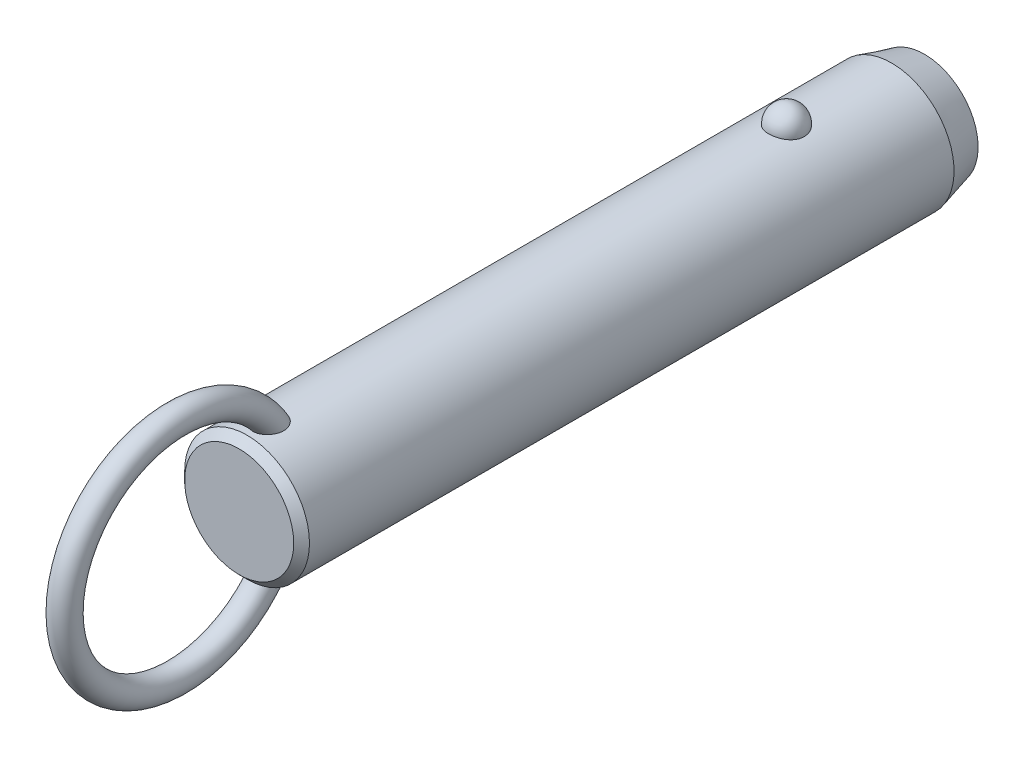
ISO-10303-21;
HEADER;
FILE_DESCRIPTION(('STEP AP214'),'2;1');
FILE_NAME('part.step','',(''),(''),'','','');
FILE_SCHEMA(('AUTOMOTIVE_DESIGN { 1 0 10303 214 1 1 1 1 }'));
ENDSEC;
DATA;
#1=APPLICATION_CONTEXT('core data for automotive mechanical design processes');
#2=APPLICATION_PROTOCOL_DEFINITION('international standard','automotive_design',2000,#1);
#3=PRODUCT_CONTEXT('',#1,'mechanical');
#4=PRODUCT('Part','Part','',(#3));
#5=PRODUCT_RELATED_PRODUCT_CATEGORY('part','',(#4));
#6=PRODUCT_DEFINITION_FORMATION('','',#4);
#7=PRODUCT_DEFINITION_CONTEXT('part definition',#1,'design');
#8=PRODUCT_DEFINITION('design','',#6,#7);
#9=PRODUCT_DEFINITION_SHAPE('','',#8);
#10=(LENGTH_UNIT() NAMED_UNIT(*) SI_UNIT(.MILLI.,.METRE.));
#11=(NAMED_UNIT(*) PLANE_ANGLE_UNIT() SI_UNIT($,.RADIAN.));
#12=(NAMED_UNIT(*) SI_UNIT($,.STERADIAN.) SOLID_ANGLE_UNIT());
#13=UNCERTAINTY_MEASURE_WITH_UNIT(LENGTH_MEASURE(1.E-05),#10,'distance_accuracy_value','');
#14=(GEOMETRIC_REPRESENTATION_CONTEXT(3) GLOBAL_UNCERTAINTY_ASSIGNED_CONTEXT((#13)) GLOBAL_UNIT_ASSIGNED_CONTEXT((#10,
#11,#12)) REPRESENTATION_CONTEXT('',''));
#15=CARTESIAN_POINT('',(0.,0.,0.));
#16=DIRECTION('',(0.,0.,1.));
#17=DIRECTION('',(1.,0.,0.));
#18=AXIS2_PLACEMENT_3D('',#15,#16,#17);
#19=CARTESIAN_POINT('',(0.,0.,71.1));
#20=DIRECTION('',(0.,0.,-1.));
#21=DIRECTION('',(-1.,0.,0.));
#22=AXIS2_PLACEMENT_3D('',#19,#20,#21);
#23=CYLINDRICAL_SURFACE('',#22,9.5);
#24=CARTESIAN_POINT('',(2.67259918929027,9.11631578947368,-2.70000000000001));
#25=CARTESIAN_POINT('',(2.6725968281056,9.11631786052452,-2.54909854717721));
#26=CARTESIAN_POINT('',(2.66030567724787,9.11994722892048,-2.39816735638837));
#27=CARTESIAN_POINT('',(2.6114347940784,9.13405924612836,-2.10058568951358));
#28=CARTESIAN_POINT('',(2.57484658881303,9.14454428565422,-1.95393672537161));
#29=CARTESIAN_POINT('',(2.47830875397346,9.17117631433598,-1.66916069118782));
#30=CARTESIAN_POINT('',(2.41836936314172,9.18732082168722,-1.53102991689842));
#31=CARTESIAN_POINT('',(2.27661331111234,9.22346780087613,-1.26705393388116));
#32=CARTESIAN_POINT('',(2.19479699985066,9.24347021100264,-1.14120852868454));
#33=CARTESIAN_POINT('',(2.01085282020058,9.28522401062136,-0.904632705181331));
#34=CARTESIAN_POINT('',(1.90862396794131,9.30698376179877,-0.793982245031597));
#35=CARTESIAN_POINT('',(1.6867437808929,9.34973971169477,-0.591607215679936));
#36=CARTESIAN_POINT('',(1.56709244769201,9.37073591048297,-0.499882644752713));
#37=CARTESIAN_POINT('',(1.31393976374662,9.40956370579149,-0.338167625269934));
#38=CARTESIAN_POINT('',(1.18048026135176,9.42740444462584,-0.268113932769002));
#39=CARTESIAN_POINT('',(0.903154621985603,9.45799906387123,-0.151390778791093));
#40=CARTESIAN_POINT('',(0.759289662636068,9.47075351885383,-0.104718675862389));
#41=CARTESIAN_POINT('',(0.468074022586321,9.48956256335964,-0.0367633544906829));
#42=CARTESIAN_POINT('',(0.320836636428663,9.49573643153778,-0.0150275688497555));
#43=CARTESIAN_POINT('',(0.0246714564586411,9.50112183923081,0.00396199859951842));
#44=CARTESIAN_POINT('',(-0.124256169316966,9.50033406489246,0.00121819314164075));
#45=CARTESIAN_POINT('',(-0.417264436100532,9.4919475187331,-0.0284441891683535));
#46=CARTESIAN_POINT('',(-0.56138413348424,9.48444885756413,-0.0550074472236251));
#47=CARTESIAN_POINT('',(-0.842986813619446,9.46357853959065,-0.131064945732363));
#48=CARTESIAN_POINT('',(-0.980469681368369,9.450206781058,-0.180559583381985));
#49=CARTESIAN_POINT('',(-1.24585005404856,9.41890822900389,-0.301476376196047));
#50=CARTESIAN_POINT('',(-1.37368611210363,9.40095498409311,-0.373026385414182));
#51=CARTESIAN_POINT('',(-1.61552738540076,9.36242964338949,-0.536025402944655));
#52=CARTESIAN_POINT('',(-1.72953116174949,9.34185727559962,-0.627476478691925));
#53=CARTESIAN_POINT('',(-1.9429225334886,9.29984568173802,-0.829844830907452));
#54=CARTESIAN_POINT('',(-2.04198021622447,9.27839736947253,-0.94110821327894));
#55=CARTESIAN_POINT('',(-2.22026460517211,9.23735994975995,-1.17883414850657));
#56=CARTESIAN_POINT('',(-2.29948985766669,9.21777097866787,-1.30529781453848));
#57=CARTESIAN_POINT('',(-2.43697287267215,9.18238994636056,-1.57158566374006));
#58=CARTESIAN_POINT('',(-2.49497068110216,9.16664569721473,-1.71155057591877));
#59=CARTESIAN_POINT('',(-2.5872073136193,9.14104303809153,-1.99961197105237));
#60=CARTESIAN_POINT('',(-2.62144683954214,9.13118445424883,-2.14770821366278));
#61=CARTESIAN_POINT('',(-2.66521466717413,9.11850622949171,-2.44715424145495));
#62=CARTESIAN_POINT('',(-2.67484831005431,9.11565658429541,-2.59848735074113));
#63=CARTESIAN_POINT('',(-2.66946735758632,9.11723375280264,-2.90067317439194));
#64=CARTESIAN_POINT('',(-2.65445345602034,9.12166036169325,-3.05152590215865));
#65=CARTESIAN_POINT('',(-2.60029711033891,9.13724422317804,-3.34766110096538));
#66=CARTESIAN_POINT('',(-2.56127978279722,9.14836656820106,-3.49296833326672));
#67=CARTESIAN_POINT('',(-2.46018844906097,9.17606676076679,-3.77477535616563));
#68=CARTESIAN_POINT('',(-2.39811349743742,9.1926448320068,-3.9112747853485));
#69=CARTESIAN_POINT('',(-2.25202303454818,9.22952198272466,-4.17244273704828));
#70=CARTESIAN_POINT('',(-2.16788714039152,9.24984129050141,-4.29704106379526));
#71=CARTESIAN_POINT('',(-1.9799408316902,9.29188255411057,-4.53013066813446));
#72=CARTESIAN_POINT('',(-1.87612963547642,9.31360456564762,-4.63862130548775));
#73=CARTESIAN_POINT('',(-1.65105429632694,9.35612959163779,-4.8369029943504));
#74=CARTESIAN_POINT('',(-1.52972405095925,9.37692871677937,-4.92661991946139));
#75=CARTESIAN_POINT('',(-1.27318250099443,9.41518970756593,-5.08429106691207));
#76=CARTESIAN_POINT('',(-1.13797219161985,9.432651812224,-5.15224684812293));
#77=CARTESIAN_POINT('',(-0.859280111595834,9.46208255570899,-5.26371827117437));
#78=CARTESIAN_POINT('',(-0.715925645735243,9.47411833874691,-5.30753421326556));
#79=CARTESIAN_POINT('',(-0.423550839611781,9.4916822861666,-5.37076321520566));
#80=CARTESIAN_POINT('',(-0.2745312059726,9.49721125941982,-5.39017930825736));
#81=CARTESIAN_POINT('',(0.0218446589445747,9.50110860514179,-5.40390587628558));
#82=CARTESIAN_POINT('',(0.16917707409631,9.49961381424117,-5.39869609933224));
#83=CARTESIAN_POINT('',(0.460808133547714,9.48993906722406,-5.36441955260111));
#84=CARTESIAN_POINT('',(0.605106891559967,9.48175936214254,-5.33535367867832));
#85=CARTESIAN_POINT('',(0.886027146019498,9.4596376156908,-5.25435587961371));
#86=CARTESIAN_POINT('',(1.02267710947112,9.44571881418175,-5.20251612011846));
#87=CARTESIAN_POINT('',(1.28523827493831,9.41358993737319,-5.07741549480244));
#88=CARTESIAN_POINT('',(1.41114877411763,9.39537958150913,-5.00415322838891));
#89=CARTESIAN_POINT('',(1.65085227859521,9.3562644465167,-4.83684599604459));
#90=CARTESIAN_POINT('',(1.76442346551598,9.33532178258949,-4.74249218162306));
#91=CARTESIAN_POINT('',(1.97425672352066,9.29321198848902,-4.53620389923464));
#92=CARTESIAN_POINT('',(2.07051582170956,9.27204482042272,-4.42426641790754));
#93=CARTESIAN_POINT('',(2.24490086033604,9.23139221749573,-4.18363183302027));
#94=CARTESIAN_POINT('',(2.32267019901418,9.21194380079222,-4.05466990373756));
#95=CARTESIAN_POINT('',(2.45584092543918,9.1773419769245,-3.78517836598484));
#96=CARTESIAN_POINT('',(2.5112497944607,9.16218713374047,-3.64465264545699));
#97=CARTESIAN_POINT('',(2.59380876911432,9.13913522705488,-3.37104301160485));
#98=CARTESIAN_POINT('',(2.62330266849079,9.13064624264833,-3.23871053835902));
#99=CARTESIAN_POINT('',(2.66269870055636,9.11923566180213,-2.97092664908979));
#100=CARTESIAN_POINT('',(2.67260130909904,9.11631393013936,-2.83547530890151));
#101=CARTESIAN_POINT('',(2.67259918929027,9.11631578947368,-2.70000000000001));
#102=B_SPLINE_CURVE_WITH_KNOTS('',3,(#24,#25,#26,#27,#28,#29,#30,#31,#32,#33,#34,#35,#36,#37,
#38,#39,#40,#41,#42,#43,#44,#45,#46,#47,#48,#49,#50,#51,#52,#53,#54,#55,#56,#57,#58,#59,#60,#61,
#62,#63,#64,#65,#66,#67,#68,#69,#70,#71,#72,#73,#74,#75,#76,#77,#78,#79,#80,#81,#82,#83,#84,#85,
#86,#87,#88,#89,#90,#91,#92,#93,#94,#95,#96,#97,#98,#99,#100,#101),.UNSPECIFIED.,.T.,.F.,(4,2,2,
2,2,2,2,2,2,2,2,2,2,2,2,2,2,2,2,2,2,2,2,2,2,2,2,2,2,2,2,2,2,2,2,2,2,2,4),(0.,0.452217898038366,
0.904593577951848,1.35677112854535,1.80894144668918,2.26340676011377,2.71787203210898,
3.17099820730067,3.62407318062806,4.0687883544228,4.51345969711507,4.95160616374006,
5.38976021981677,5.83050358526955,6.27129275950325,6.72071308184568,7.17016633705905,
7.62495278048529,8.07972578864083,8.53254856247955,8.98535859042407,9.43582813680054,
9.88631615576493,10.3393155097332,10.7923328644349,11.2471065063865,11.7018475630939,
12.150795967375,12.599688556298,13.0398725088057,13.4800399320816,13.9184421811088,
14.3568730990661,14.802202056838,15.2476074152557,15.7010097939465,16.1542603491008,
16.5602594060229,16.966248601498),.UNSPECIFIED.);
#103=CARTESIAN_POINT('',(2.67259918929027,9.11631578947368,-2.70000000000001));
#104=VERTEX_POINT('',#103);
#105=EDGE_CURVE('E41',#104,#104,#102,.T.);
#106=ORIENTED_EDGE('',*,*,#105,.T.);
#107=EDGE_LOOP('',(#106));
#108=FACE_BOUND('',#107,.T.);
#109=CARTESIAN_POINT('',(0.,0.,79.42));
#110=DIRECTION('',(0.,0.,1.));
#111=DIRECTION('',(1.,0.,0.));
#112=AXIS2_PLACEMENT_3D('',#109,#110,#111);
#113=CIRCLE('',#112,9.5);
#114=CARTESIAN_POINT('',(9.5,0.,79.42));
#115=VERTEX_POINT('',#114);
#116=EDGE_CURVE('E10',#115,#115,#113,.F.);
#117=ORIENTED_EDGE('',*,*,#116,.T.);
#118=EDGE_LOOP('',(#117));
#119=FACE_BOUND('',#118,.T.);
#120=CARTESIAN_POINT('',(-0.697062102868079,-9.47439269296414,73.7678088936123));
#121=CARTESIAN_POINT('',(-0.799579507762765,-9.46685146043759,73.8074823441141));
#122=CARTESIAN_POINT('',(-0.898575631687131,-9.45788043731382,73.8559309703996));
#123=CARTESIAN_POINT('',(-1.08670047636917,-9.43811593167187,73.9688685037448));
#124=CARTESIAN_POINT('',(-1.17583204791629,-9.42732297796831,74.0333527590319));
#125=CARTESIAN_POINT('',(-1.34179806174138,-9.40513672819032,74.1762099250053));
#126=CARTESIAN_POINT('',(-1.41865133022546,-9.39374438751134,74.254561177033));
#127=CARTESIAN_POINT('',(-1.5586004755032,-9.37154196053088,74.4227524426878));
#128=CARTESIAN_POINT('',(-1.62169476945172,-9.3607319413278,74.5125937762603));
#129=CARTESIAN_POINT('',(-1.73527695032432,-9.34035749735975,74.7045001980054));
#130=CARTESIAN_POINT('',(-1.7852226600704,-9.33085270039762,74.8068910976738));
#131=CARTESIAN_POINT('',(-1.86924997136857,-9.3143834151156,75.018148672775));
#132=CARTESIAN_POINT('',(-1.90332570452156,-9.30741986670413,75.1270177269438));
#133=CARTESIAN_POINT('',(-1.95893603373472,-9.29588482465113,75.3604730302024));
#134=CARTESIAN_POINT('',(-1.97872420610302,-9.29165182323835,75.4854890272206));
#135=CARTESIAN_POINT('',(-2.00062129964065,-9.28695978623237,75.7370805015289));
#136=CARTESIAN_POINT('',(-2.00272284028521,-9.28650232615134,75.863656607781));
#137=CARTESIAN_POINT('',(-1.98958876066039,-9.28932750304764,76.1368157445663));
#138=CARTESIAN_POINT('',(-1.97143366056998,-9.2932400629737,76.2832519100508));
#139=CARTESIAN_POINT('',(-1.91479925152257,-9.30507151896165,76.5720629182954));
#140=CARTESIAN_POINT('',(-1.87629122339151,-9.31299607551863,76.714431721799));
#141=CARTESIAN_POINT('',(-1.77225683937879,-9.33340232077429,77.0151725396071));
#142=CARTESIAN_POINT('',(-1.70334898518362,-9.34641636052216,77.1723691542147));
#143=CARTESIAN_POINT('',(-1.58111062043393,-9.36759153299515,77.3975171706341));
#144=CARTESIAN_POINT('',(-1.53721459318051,-9.37492619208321,77.4707968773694));
#145=CARTESIAN_POINT('',(-1.44302631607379,-9.38988566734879,77.6130740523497));
#146=CARTESIAN_POINT('',(-1.39273721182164,-9.39751033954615,77.6820736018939));
#147=CARTESIAN_POINT('',(-1.26775962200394,-9.41530678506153,77.8369832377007));
#148=CARTESIAN_POINT('',(-1.19052326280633,-9.42548108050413,77.9208712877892));
#149=CARTESIAN_POINT('',(-1.02420241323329,-9.44499825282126,78.0760086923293));
#150=CARTESIAN_POINT('',(-0.935139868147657,-9.45434261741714,78.1472808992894));
#151=CARTESIAN_POINT('',(-0.766610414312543,-9.46930670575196,78.2586955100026));
#152=CARTESIAN_POINT('',(-0.689439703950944,-9.47529223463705,78.3022354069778));
#153=CARTESIAN_POINT('',(-0.528942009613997,-9.48560294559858,78.3763133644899));
#154=CARTESIAN_POINT('',(-0.445620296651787,-9.48992953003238,78.4068624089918));
#155=CARTESIAN_POINT('',(-0.273901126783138,-9.49644161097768,78.4525792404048));
#156=CARTESIAN_POINT('',(-0.185465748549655,-9.49860811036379,78.46761059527));
#157=CARTESIAN_POINT('',(-0.00734541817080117,-9.5004135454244,78.4801494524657));
#158=CARTESIAN_POINT('',(0.0823387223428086,-9.50005405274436,78.4776678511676));
#159=CARTESIAN_POINT('',(0.247679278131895,-9.49708301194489,78.4569959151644));
#160=CARTESIAN_POINT('',(0.323620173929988,-9.49477609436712,78.4409300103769));
#161=CARTESIAN_POINT('',(0.471981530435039,-9.48855917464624,78.3971726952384));
#162=CARTESIAN_POINT('',(0.544400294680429,-9.48464840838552,78.3694757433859));
#163=CARTESIAN_POINT('',(0.70894789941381,-9.47398336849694,78.2928026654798));
#164=CARTESIAN_POINT('',(0.799149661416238,-9.46671310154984,78.2397745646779));
#165=CARTESIAN_POINT('',(0.969783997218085,-9.45076225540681,78.1199731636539));
#166=CARTESIAN_POINT('',(1.05019415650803,-9.44207854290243,78.0531692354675));
#167=CARTESIAN_POINT('',(1.23092343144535,-9.42051459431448,77.8807596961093));
#168=CARTESIAN_POINT('',(1.3265249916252,-9.40733378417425,77.7702619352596));
#169=CARTESIAN_POINT('',(1.49893121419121,-9.38140745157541,77.5355614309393));
#170=CARTESIAN_POINT('',(1.57571616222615,-9.36866239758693,77.4113445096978));
#171=CARTESIAN_POINT('',(1.71285426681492,-9.34457644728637,77.1493891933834));
#172=CARTESIAN_POINT('',(1.77266365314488,-9.33328726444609,77.0113623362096));
#173=CARTESIAN_POINT('',(1.87239208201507,-9.31379209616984,76.7280515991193));
#174=CARTESIAN_POINT('',(1.9123015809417,-9.3055875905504,76.582764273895));
#175=CARTESIAN_POINT('',(1.97604189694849,-9.29228394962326,76.2620281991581));
#176=CARTESIAN_POINT('',(1.99587438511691,-9.28797202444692,76.0857248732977));
#177=CARTESIAN_POINT('',(2.0029570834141,-9.28645519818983,75.7324146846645));
#178=CARTESIAN_POINT('',(1.99025930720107,-9.28923895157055,75.5554093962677));
#179=CARTESIAN_POINT('',(1.93735479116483,-9.30038134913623,75.2563381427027));
#180=CARTESIAN_POINT('',(1.90576827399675,-9.30697680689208,75.1326679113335));
#181=CARTESIAN_POINT('',(1.82287484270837,-9.32356855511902,74.892329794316));
#182=CARTESIAN_POINT('',(1.77158213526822,-9.33356239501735,74.7756569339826));
#183=CARTESIAN_POINT('',(1.64885744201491,-9.35602275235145,74.5527061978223));
#184=CARTESIAN_POINT('',(1.57730995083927,-9.36850332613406,74.4464927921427));
#185=CARTESIAN_POINT('',(1.4154326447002,-9.39431873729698,74.2495530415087));
#186=CARTESIAN_POINT('',(1.32510883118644,-9.40765330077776,74.1588217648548));
#187=CARTESIAN_POINT('',(1.13846223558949,-9.43195720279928,74.0050334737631));
#188=CARTESIAN_POINT('',(1.04369890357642,-9.44302894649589,73.9400947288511));
#189=CARTESIAN_POINT('',(0.843965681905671,-9.46296805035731,73.8280388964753));
#190=CARTESIAN_POINT('',(0.739000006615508,-9.47183631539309,73.7809144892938));
#191=CARTESIAN_POINT('',(0.528175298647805,-9.48586140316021,73.7081173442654));
#192=CARTESIAN_POINT('',(0.422686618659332,-9.49119633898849,73.6814024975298));
#193=CARTESIAN_POINT('',(0.208590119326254,-9.49831365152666,73.6460137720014));
#194=CARTESIAN_POINT('',(0.0999817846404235,-9.500095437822,73.6373428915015));
#195=CARTESIAN_POINT('',(-0.126104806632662,-9.49988861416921,73.6383501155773));
#196=CARTESIAN_POINT('',(-0.24357872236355,-9.49757821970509,73.6495942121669));
#197=CARTESIAN_POINT('',(-0.474390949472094,-9.48885165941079,73.693167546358));
#198=CARTESIAN_POINT('',(-0.587729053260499,-9.48243528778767,73.7254978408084));
#199=CARTESIAN_POINT('',(-0.697062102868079,-9.47439269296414,73.7678088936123));
#200=B_SPLINE_CURVE_WITH_KNOTS('',3,(#120,#121,#122,#123,#124,#125,#126,#127,#128,#129,#130,
#131,#132,#133,#134,#135,#136,#137,#138,#139,#140,#141,#142,#143,#144,#145,#146,#147,#148,#149,
#150,#151,#152,#153,#154,#155,#156,#157,#158,#159,#160,#161,#162,#163,#164,#165,#166,#167,#168,
#169,#170,#171,#172,#173,#174,#175,#176,#177,#178,#179,#180,#181,#182,#183,#184,#185,#186,#187,
#188,#189,#190,#191,#192,#193,#194,#195,#196,#197,#198,#199),.UNSPECIFIED.,.T.,.F.,(4,2,2,2,2,2,
2,2,2,2,2,2,2,2,2,2,2,2,2,2,2,2,2,2,2,2,2,2,2,2,2,2,2,2,2,2,2,2,2,4),(0.,0.330119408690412,
0.660143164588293,0.989655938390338,1.31920659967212,1.66074728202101,2.00241415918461,
2.38088696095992,2.7595176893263,3.20065679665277,3.6424200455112,4.15620996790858,
4.4131416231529,4.66994734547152,5.01228664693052,5.35399933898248,5.61943037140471,
5.88463652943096,6.15215502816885,6.41950709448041,6.65144391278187,6.88349136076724,
7.19641200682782,7.51003602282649,7.94779711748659,8.38601491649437,8.83699707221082,
9.28819530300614,9.81778662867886,10.3465317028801,10.7284172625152,11.110028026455,
11.4938603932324,11.8775702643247,12.2220189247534,12.5663259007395,12.8915939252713,
13.2169159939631,13.5689650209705,13.9210316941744),.UNSPECIFIED.);
#201=CARTESIAN_POINT('',(-0.697062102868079,-9.47439269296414,73.7678088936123));
#202=VERTEX_POINT('',#201);
#203=EDGE_CURVE('E59',#202,#202,#200,.T.);
#204=ORIENTED_EDGE('',*,*,#203,.T.);
#205=EDGE_LOOP('',(#204));
#206=FACE_BOUND('',#205,.T.);
#207=CARTESIAN_POINT('',(-0.697062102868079,9.47439269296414,73.7678088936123));
#208=CARTESIAN_POINT('',(-0.597792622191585,9.48169483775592,73.7293956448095));
#209=CARTESIAN_POINT('',(-0.495106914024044,9.48766580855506,73.6991682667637));
#210=CARTESIAN_POINT('',(-0.285876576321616,9.49627648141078,73.6560327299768));
#211=CARTESIAN_POINT('',(-0.179324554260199,9.49890941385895,73.6431597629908));
#212=CARTESIAN_POINT('',(0.034415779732,9.50053798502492,73.6351666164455));
#213=CARTESIAN_POINT('',(0.141603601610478,9.49953613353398,73.6400341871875));
#214=CARTESIAN_POINT('',(0.353563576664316,9.49401038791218,73.6673654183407));
#215=CARTESIAN_POINT('',(0.458336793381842,9.48948807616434,73.68982117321));
#216=CARTESIAN_POINT('',(0.66249373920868,9.4774236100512,73.7516719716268));
#217=CARTESIAN_POINT('',(0.761881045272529,9.46988348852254,73.7910556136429));
#218=CARTESIAN_POINT('',(0.952608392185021,9.45260382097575,73.8856342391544));
#219=CARTESIAN_POINT('',(1.04394806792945,9.44286417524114,73.9408299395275));
#220=CARTESIAN_POINT('',(1.21712767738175,9.42211760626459,74.0660662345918));
#221=CARTESIAN_POINT('',(1.29885671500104,9.41109835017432,74.1362579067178));
#222=CARTESIAN_POINT('',(1.44978975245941,9.38903310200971,74.288980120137));
#223=CARTESIAN_POINT('',(1.51899278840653,9.37798710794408,74.3715116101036));
#224=CARTESIAN_POINT('',(1.64602857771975,9.35654375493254,74.5497763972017));
#225=CARTESIAN_POINT('',(1.70333052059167,9.34618688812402,74.6458916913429));
#226=CARTESIAN_POINT('',(1.80259341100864,9.32755128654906,74.845897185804));
#227=CARTESIAN_POINT('',(1.84454942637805,9.31927322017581,74.9497898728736));
#228=CARTESIAN_POINT('',(1.91637039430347,9.30478365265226,75.1722131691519));
#229=CARTESIAN_POINT('',(1.944805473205,9.29882552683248,75.2912192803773));
#230=CARTESIAN_POINT('',(1.98449865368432,9.29043398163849,75.5321436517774));
#231=CARTESIAN_POINT('',(1.99574908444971,9.28800213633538,75.6540631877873));
#232=CARTESIAN_POINT('',(2.00275141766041,9.28649645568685,75.9169324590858));
#233=CARTESIAN_POINT('',(1.99588238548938,9.28799035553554,76.0579529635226));
#234=CARTESIAN_POINT('',(1.96270559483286,9.29505517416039,76.3376217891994));
#235=CARTESIAN_POINT('',(1.93637872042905,9.30063010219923,76.476267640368));
#236=CARTESIAN_POINT('',(1.85949176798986,9.31633564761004,76.7725616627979));
#237=CARTESIAN_POINT('',(1.80549792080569,9.3270926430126,76.9292907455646));
#238=CARTESIAN_POINT('',(1.67376869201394,9.3516306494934,77.2322840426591));
#239=CARTESIAN_POINT('',(1.59603181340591,9.36541185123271,77.3785475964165));
#240=CARTESIAN_POINT('',(1.4360277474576,9.39110706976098,77.6258138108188));
#241=CARTESIAN_POINT('',(1.35831795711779,9.40278656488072,77.729791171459));
#242=CARTESIAN_POINT('',(1.18774483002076,9.42585025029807,77.9245347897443));
#243=CARTESIAN_POINT('',(1.09490932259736,9.43723493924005,78.0153247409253));
#244=CARTESIAN_POINT('',(0.921110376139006,9.45552616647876,78.1562033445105));
#245=CARTESIAN_POINT('',(0.843738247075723,9.46281058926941,78.2106563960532));
#246=CARTESIAN_POINT('',(0.681245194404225,9.47589120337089,78.3067117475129));
#247=CARTESIAN_POINT('',(0.596135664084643,9.48168953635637,78.3483325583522));
#248=CARTESIAN_POINT('',(0.433779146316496,9.49038144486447,78.4100899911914));
#249=CARTESIAN_POINT('',(0.357459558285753,9.49359170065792,78.4326013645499));
#250=CARTESIAN_POINT('',(0.202074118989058,9.49816761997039,78.4645745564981));
#251=CARTESIAN_POINT('',(0.123010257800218,9.49953459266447,78.4740456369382));
#252=CARTESIAN_POINT('',(-0.0357372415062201,9.50026497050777,78.4791143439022));
#253=CARTESIAN_POINT('',(-0.115421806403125,9.49962433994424,78.4746840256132));
#254=CARTESIAN_POINT('',(-0.272823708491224,9.49640854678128,78.4522962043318));
#255=CARTESIAN_POINT('',(-0.350540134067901,9.4938325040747,78.4343325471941));
#256=CARTESIAN_POINT('',(-0.500580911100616,9.4870946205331,78.3868028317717));
#257=CARTESIAN_POINT('',(-0.57297929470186,9.48296359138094,78.3574618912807));
#258=CARTESIAN_POINT('',(-0.712864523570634,9.47347609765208,78.2890087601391));
#259=CARTESIAN_POINT('',(-0.780349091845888,9.46811906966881,78.2498920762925));
#260=CARTESIAN_POINT('',(-0.946309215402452,9.45329720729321,78.139432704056));
#261=CARTESIAN_POINT('',(-1.04090230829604,9.44321512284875,78.0623297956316));
#262=CARTESIAN_POINT('',(-1.21661929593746,9.42219227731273,77.8940971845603));
#263=CARTESIAN_POINT('',(-1.29770519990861,9.41124921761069,77.8029292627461));
#264=CARTESIAN_POINT('',(-1.47319646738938,9.38563439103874,77.5761621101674));
#265=CARTESIAN_POINT('',(-1.56208878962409,9.37102009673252,77.4362895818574));
#266=CARTESIAN_POINT('',(-1.71623987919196,9.34401559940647,77.1439503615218));
#267=CARTESIAN_POINT('',(-1.78147866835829,9.33162728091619,76.991473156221));
#268=CARTESIAN_POINT('',(-1.88853837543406,9.31055541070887,76.6756470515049));
#269=CARTESIAN_POINT('',(-1.92998995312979,9.30193076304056,76.5121685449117));
#270=CARTESIAN_POINT('',(-1.98590726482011,9.29015757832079,76.1805268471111));
#271=CARTESIAN_POINT('',(-2.0004070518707,9.2870021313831,76.0123698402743));
#272=CARTESIAN_POINT('',(-1.99964701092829,9.28716218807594,75.7050806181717));
#273=CARTESIAN_POINT('',(-1.98908145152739,9.28945704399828,75.5659362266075));
#274=CARTESIAN_POINT('',(-1.94566294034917,9.29865169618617,75.2911539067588));
#275=CARTESIAN_POINT('',(-1.91282062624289,9.30554929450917,75.155514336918));
#276=CARTESIAN_POINT('',(-1.84582133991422,9.31898248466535,74.9578026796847));
#277=CARTESIAN_POINT('',(-1.82038084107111,9.32400364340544,74.892583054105));
#278=CARTESIAN_POINT('',(-1.7635051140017,9.33492884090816,74.7649033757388));
#279=CARTESIAN_POINT('',(-1.73207305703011,9.34083241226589,74.7024418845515));
#280=CARTESIAN_POINT('',(-1.6632424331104,9.353333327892,74.5809407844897));
#281=CARTESIAN_POINT('',(-1.62584239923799,9.35993084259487,74.5219020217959));
#282=CARTESIAN_POINT('',(-1.54527678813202,9.37356864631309,74.4079875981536));
#283=CARTESIAN_POINT('',(-1.50211241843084,9.38060884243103,74.3531110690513));
#284=CARTESIAN_POINT('',(-1.37681147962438,9.40004442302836,74.2099619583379));
#285=CARTESIAN_POINT('',(-1.28916358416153,9.41261047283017,74.1264295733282));
#286=CARTESIAN_POINT('',(-1.09996826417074,9.43658180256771,73.9772360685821));
#287=CARTESIAN_POINT('',(-0.998461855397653,9.44799034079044,73.9115238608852));
#288=CARTESIAN_POINT('',(-0.860188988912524,9.46103017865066,73.8394367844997));
#289=CARTESIAN_POINT('',(-0.828141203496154,9.46389141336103,73.8238511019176));
#290=CARTESIAN_POINT('',(-0.763210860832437,9.46934915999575,73.7944734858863));
#291=CARTESIAN_POINT('',(-0.730328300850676,9.47194567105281,73.7806815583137));
#292=CARTESIAN_POINT('',(-0.697062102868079,9.47439269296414,73.7678088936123));
#293=B_SPLINE_CURVE_WITH_KNOTS('',3,(#207,#208,#209,#210,#211,#212,#213,#214,#215,#216,#217,
#218,#219,#220,#221,#222,#223,#224,#225,#226,#227,#228,#229,#230,#231,#232,#233,#234,#235,#236,
#237,#238,#239,#240,#241,#242,#243,#244,#245,#246,#247,#248,#249,#250,#251,#252,#253,#254,#255,
#256,#257,#258,#259,#260,#261,#262,#263,#264,#265,#266,#267,#268,#269,#270,#271,#272,#273,#274,
#275,#276,#277,#278,#279,#280,#281,#282,#283,#284,#285,#286,#287,#288,#289,#290,#291,#292),
.UNSPECIFIED.,.T.,.F.,(4,2,2,2,2,2,2,2,2,2,2,2,2,2,2,2,2,2,2,2,2,2,2,2,2,2,2,2,2,2,2,2,2,2,2,2,
2,2,2,2,2,2,4),(0.,0.319942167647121,0.640532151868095,0.960900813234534,1.28112555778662,
1.60113495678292,1.92115886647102,2.24457323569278,2.56801248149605,2.90371927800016,
3.23953387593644,3.60560313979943,3.97183576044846,4.39383693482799,4.81625324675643,
5.31257045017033,5.80891895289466,6.19868344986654,6.58773876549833,6.87145417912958,
7.15475838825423,7.3926375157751,7.63034760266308,7.86853584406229,8.10683246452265,
8.3406366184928,8.57454843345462,8.93983939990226,9.30614105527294,9.8026666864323,
10.2996107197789,10.8040753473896,11.3079021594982,11.7249776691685,12.1418541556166,
12.3521485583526,12.562331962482,12.7725671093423,12.9827582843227,13.3458276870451,
13.7078449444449,13.8150604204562,13.9222762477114),.UNSPECIFIED.);
#294=CARTESIAN_POINT('',(-0.697062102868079,9.47439269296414,73.7678088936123));
#295=VERTEX_POINT('',#294);
#296=EDGE_CURVE('E67',#295,#295,#293,.T.);
#297=ORIENTED_EDGE('',*,*,#296,.T.);
#298=EDGE_LOOP('',(#297));
#299=FACE_BOUND('',#298,.T.);
#300=CARTESIAN_POINT('',(0.,0.,-18.6999999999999));
#301=DIRECTION('',(0.,0.,-1.));
#302=DIRECTION('',(-1.,0.,0.));
#303=AXIS2_PLACEMENT_3D('',#300,#301,#302);
#304=CIRCLE('',#303,9.5);
#305=CARTESIAN_POINT('',(-9.5,0.,-18.6999999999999));
#306=VERTEX_POINT('',#305);
#307=EDGE_CURVE('E56',#306,#306,#304,.F.);
#308=ORIENTED_EDGE('',*,*,#307,.T.);
#309=EDGE_LOOP('',(#308));
#310=FACE_BOUND('',#309,.T.);
#311=ADVANCED_FACE('F37',(#108,#119,#206,#299,#310),#23,.T.);
#312=CARTESIAN_POINT('',(0.,0.,-23.7));
#313=DIRECTION('',(0.,0.,-1.));
#314=DIRECTION('',(-1.,0.,0.));
#315=AXIS2_PLACEMENT_3D('',#312,#313,#314);
#316=PLANE('',#315);
#317=CARTESIAN_POINT('',(0.,0.,-23.7));
#318=DIRECTION('',(0.,0.,-1.));
#319=DIRECTION('',(-1.,0.,0.));
#320=AXIS2_PLACEMENT_3D('',#317,#318,#319);
#321=CIRCLE('',#320,8.16025403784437);
#322=CARTESIAN_POINT('',(-8.16025403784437,0.,-23.7));
#323=VERTEX_POINT('',#322);
#324=EDGE_CURVE('E66',#323,#323,#321,.T.);
#325=ORIENTED_EDGE('',*,*,#324,.T.);
#326=EDGE_LOOP('',(#325));
#327=FACE_BOUND('',#326,.T.);
#328=ADVANCED_FACE('F85',(#327),#316,.T.);
#329=CARTESIAN_POINT('',(0.,0.,-23.7));
#330=DIRECTION('',(0.,0.,1.));
#331=DIRECTION('',(1.,0.,0.));
#332=AXIS2_PLACEMENT_3D('',#329,#330,#331);
#333=CONICAL_SURFACE('',#332,8.16025403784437,0.261799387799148);
#334=ORIENTED_EDGE('',*,*,#307,.F.);
#335=EDGE_LOOP('',(#334));
#336=FACE_BOUND('',#335,.T.);
#337=ORIENTED_EDGE('',*,*,#324,.F.);
#338=EDGE_LOOP('',(#337));
#339=FACE_BOUND('',#338,.T.);
#340=ADVANCED_FACE('F83',(#336,#339),#333,.T.);
#341=CARTESIAN_POINT('',(0.,0.,80.62));
#342=DIRECTION('',(0.,0.,1.));
#343=DIRECTION('',(1.,0.,0.));
#344=AXIS2_PLACEMENT_3D('',#341,#342,#343);
#345=PLANE('',#344);
#346=CARTESIAN_POINT('',(0.,0.,80.62));
#347=DIRECTION('',(0.,0.,1.));
#348=DIRECTION('',(1.,0.,0.));
#349=AXIS2_PLACEMENT_3D('',#346,#347,#348);
#350=CIRCLE('',#349,8.3);
#351=CARTESIAN_POINT('',(8.3,0.,80.62));
#352=VERTEX_POINT('',#351);
#353=EDGE_CURVE('E50',#352,#352,#350,.T.);
#354=ORIENTED_EDGE('',*,*,#353,.T.);
#355=EDGE_LOOP('',(#354));
#356=FACE_BOUND('',#355,.T.);
#357=ADVANCED_FACE('F77',(#356),#345,.T.);
#358=CARTESIAN_POINT('',(0.,0.,90.15));
#359=DIRECTION('',(1.,0.,0.));
#360=DIRECTION('',(0.,0.,-1.));
#361=AXIS2_PLACEMENT_3D('',#358,#359,#360);
#362=TOROIDAL_SURFACE('',#361,17.05,2.);
#363=ORIENTED_EDGE('',*,*,#296,.F.);
#364=EDGE_LOOP('',(#363));
#365=FACE_BOUND('',#364,.T.);
#366=ORIENTED_EDGE('',*,*,#203,.F.);
#367=EDGE_LOOP('',(#366));
#368=FACE_BOUND('',#367,.T.);
#369=ADVANCED_FACE('F73',(#365,#368),#362,.T.);
#370=CARTESIAN_POINT('',(0.,0.,80.62));
#371=DIRECTION('',(0.,0.,-1.));
#372=DIRECTION('',(-1.,0.,0.));
#373=AXIS2_PLACEMENT_3D('',#370,#371,#372);
#374=CONICAL_SURFACE('',#373,8.3,0.78539816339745);
#375=ORIENTED_EDGE('',*,*,#116,.F.);
#376=EDGE_LOOP('',(#375));
#377=FACE_BOUND('',#376,.T.);
#378=ORIENTED_EDGE('',*,*,#353,.F.);
#379=EDGE_LOOP('',(#378));
#380=FACE_BOUND('',#379,.T.);
#381=ADVANCED_FACE('F39',(#377,#380),#374,.T.);
#382=CARTESIAN_POINT('',(0.,9.5,-2.70000000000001));
#383=DIRECTION('',(0.,1.,0.));
#384=DIRECTION('',(0.,0.,-1.));
#385=AXIS2_PLACEMENT_3D('',#382,#383,#384);
#386=SPHERICAL_SURFACE('',#385,2.7);
#387=ORIENTED_EDGE('',*,*,#105,.F.);
#388=EDGE_LOOP('',(#387));
#389=FACE_BOUND('',#388,.T.);
#390=ADVANCED_FACE('F79',(#389),#386,.T.);
#391=CLOSED_SHELL('',(#311,#328,#340,#357,#369,#381,#390));
#392=MANIFOLD_SOLID_BREP('B2',#391);
#393=ADVANCED_BREP_SHAPE_REPRESENTATION('',(#18,#392),#14);
#394=SHAPE_DEFINITION_REPRESENTATION(#9,#393);
ENDSEC;
END-ISO-10303-21;
